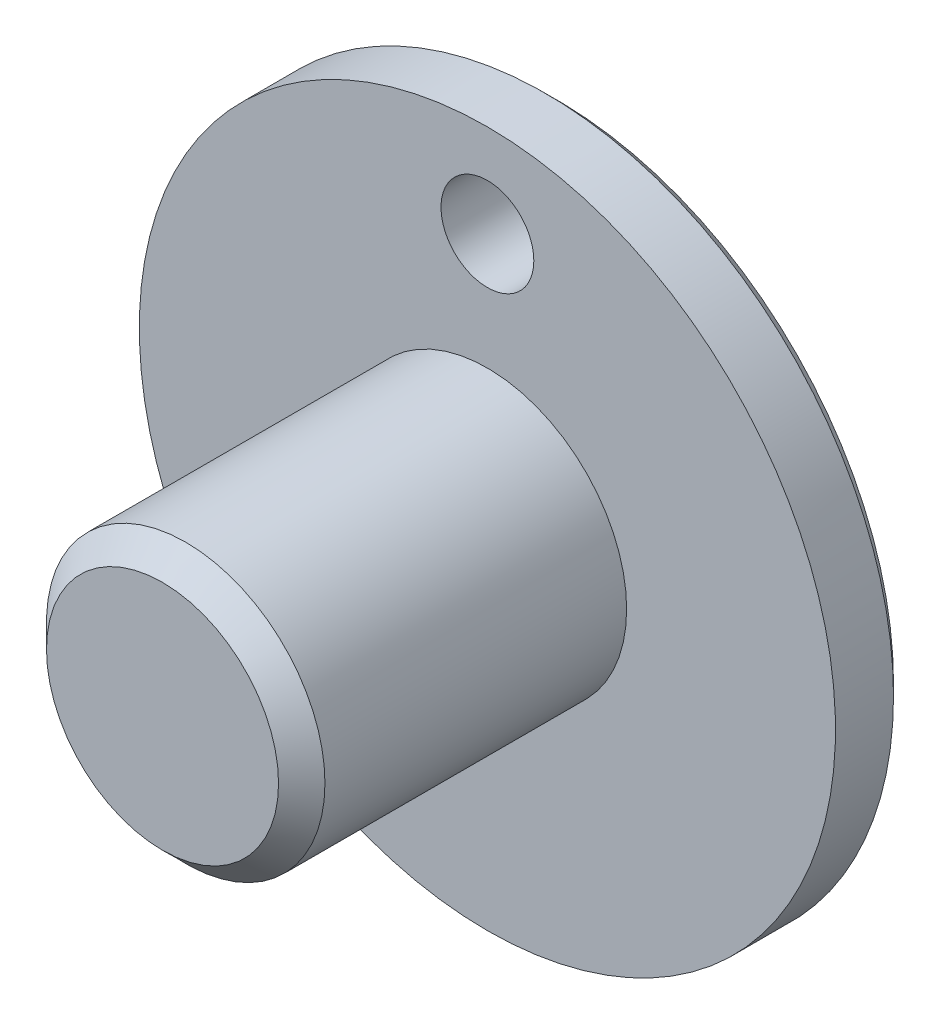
ISO-10303-21;
HEADER;
FILE_DESCRIPTION(('STEP AP214'),'2;1');
FILE_NAME('part.step','',(''),(''),'','','');
FILE_SCHEMA(('AUTOMOTIVE_DESIGN { 1 0 10303 214 1 1 1 1 }'));
ENDSEC;
DATA;
#1=APPLICATION_CONTEXT('core data for automotive mechanical design processes');
#2=APPLICATION_PROTOCOL_DEFINITION('international standard','automotive_design',2000,#1);
#3=PRODUCT_CONTEXT('',#1,'mechanical');
#4=PRODUCT('Part','Part','',(#3));
#5=PRODUCT_RELATED_PRODUCT_CATEGORY('part','',(#4));
#6=PRODUCT_DEFINITION_FORMATION('','',#4);
#7=PRODUCT_DEFINITION_CONTEXT('part definition',#1,'design');
#8=PRODUCT_DEFINITION('design','',#6,#7);
#9=PRODUCT_DEFINITION_SHAPE('','',#8);
#10=(LENGTH_UNIT() NAMED_UNIT(*) SI_UNIT(.MILLI.,.METRE.));
#11=(NAMED_UNIT(*) PLANE_ANGLE_UNIT() SI_UNIT($,.RADIAN.));
#12=(NAMED_UNIT(*) SI_UNIT($,.STERADIAN.) SOLID_ANGLE_UNIT());
#13=UNCERTAINTY_MEASURE_WITH_UNIT(LENGTH_MEASURE(1.E-05),#10,'distance_accuracy_value','');
#14=(GEOMETRIC_REPRESENTATION_CONTEXT(3) GLOBAL_UNCERTAINTY_ASSIGNED_CONTEXT((#13)) GLOBAL_UNIT_ASSIGNED_CONTEXT((#10,
#11,#12)) REPRESENTATION_CONTEXT('',''));
#15=CARTESIAN_POINT('',(0.,0.,0.));
#16=DIRECTION('',(0.,0.,1.));
#17=DIRECTION('',(1.,0.,0.));
#18=AXIS2_PLACEMENT_3D('',#15,#16,#17);
#19=CARTESIAN_POINT('',(-5.,-5.,14.));
#20=DIRECTION('',(0.,0.,1.));
#21=DIRECTION('',(1.,0.,0.));
#22=AXIS2_PLACEMENT_3D('',#19,#20,#21);
#23=PLANE('',#22);
#24=CARTESIAN_POINT('',(0.,0.,14.));
#25=DIRECTION('',(0.,0.,-1.));
#26=DIRECTION('',(0.,1.,0.));
#27=AXIS2_PLACEMENT_3D('',#24,#25,#26);
#28=CIRCLE('',#27,5.);
#29=CARTESIAN_POINT('',(0.,5.,14.));
#30=VERTEX_POINT('',#29);
#31=EDGE_CURVE('E51',#30,#30,#28,.F.);
#32=ORIENTED_EDGE('',*,*,#31,.T.);
#33=EDGE_LOOP('',(#32));
#34=FACE_BOUND('',#33,.T.);
#35=ADVANCED_FACE('F14',(#34),#23,.T.);
#36=CARTESIAN_POINT('',(0.,0.,-3.));
#37=DIRECTION('',(0.,0.,1.));
#38=DIRECTION('',(1.,0.,0.));
#39=AXIS2_PLACEMENT_3D('',#36,#37,#38);
#40=CONICAL_SURFACE('',#39,14.5,0.785398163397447);
#41=CARTESIAN_POINT('',(0.,0.,-3.));
#42=DIRECTION('',(0.,0.,1.));
#43=DIRECTION('',(1.,0.,0.));
#44=AXIS2_PLACEMENT_3D('',#41,#42,#43);
#45=CIRCLE('',#44,14.5);
#46=CARTESIAN_POINT('',(14.5,0.,-3.));
#47=VERTEX_POINT('',#46);
#48=EDGE_CURVE('E47',#47,#47,#45,.F.);
#49=ORIENTED_EDGE('',*,*,#48,.F.);
#50=EDGE_LOOP('',(#49));
#51=FACE_BOUND('',#50,.T.);
#52=CARTESIAN_POINT('',(0.,0.,-2.5));
#53=DIRECTION('',(0.,0.,1.));
#54=DIRECTION('',(1.,0.,0.));
#55=AXIS2_PLACEMENT_3D('',#52,#53,#54);
#56=CIRCLE('',#55,15.);
#57=CARTESIAN_POINT('',(15.,0.,-2.5));
#58=VERTEX_POINT('',#57);
#59=EDGE_CURVE('E50',#58,#58,#56,.F.);
#60=ORIENTED_EDGE('',*,*,#59,.T.);
#61=EDGE_LOOP('',(#60));
#62=FACE_BOUND('',#61,.T.);
#63=ADVANCED_FACE('F60',(#51,#62),#40,.T.);
#64=CARTESIAN_POINT('',(0.,0.,13.));
#65=DIRECTION('',(0.,0.,-1.));
#66=DIRECTION('',(0.,1.,0.));
#67=AXIS2_PLACEMENT_3D('',#64,#65,#66);
#68=CONICAL_SURFACE('',#67,6.,0.785398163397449);
#69=CARTESIAN_POINT('',(0.,0.,13.));
#70=DIRECTION('',(0.,0.,1.));
#71=DIRECTION('',(1.,0.,0.));
#72=AXIS2_PLACEMENT_3D('',#69,#70,#71);
#73=CIRCLE('',#72,6.);
#74=CARTESIAN_POINT('',(6.,0.,13.));
#75=VERTEX_POINT('',#74);
#76=EDGE_CURVE('E44',#75,#75,#73,.T.);
#77=ORIENTED_EDGE('',*,*,#76,.T.);
#78=EDGE_LOOP('',(#77));
#79=FACE_BOUND('',#78,.T.);
#80=ORIENTED_EDGE('',*,*,#31,.F.);
#81=EDGE_LOOP('',(#80));
#82=FACE_BOUND('',#81,.T.);
#83=ADVANCED_FACE('F57',(#79,#82),#68,.T.);
#84=CARTESIAN_POINT('',(14.5,-14.5,-3.));
#85=DIRECTION('',(0.,0.,-1.));
#86=DIRECTION('',(-1.,0.,0.));
#87=AXIS2_PLACEMENT_3D('',#84,#85,#86);
#88=PLANE('',#87);
#89=CARTESIAN_POINT('',(0.,11.,-3.));
#90=DIRECTION('',(0.,0.,1.));
#91=DIRECTION('',(1.,0.,0.));
#92=AXIS2_PLACEMENT_3D('',#89,#90,#91);
#93=CIRCLE('',#92,2.);
#94=CARTESIAN_POINT('',(2.,11.,-3.));
#95=VERTEX_POINT('',#94);
#96=EDGE_CURVE('E39',#95,#95,#93,.F.);
#97=ORIENTED_EDGE('',*,*,#96,.F.);
#98=EDGE_LOOP('',(#97));
#99=FACE_BOUND('',#98,.T.);
#100=ORIENTED_EDGE('',*,*,#48,.T.);
#101=EDGE_LOOP('',(#100));
#102=FACE_BOUND('',#101,.T.);
#103=ADVANCED_FACE('F59',(#99,#102),#88,.T.);
#104=CARTESIAN_POINT('',(0.,0.,-2.5));
#105=DIRECTION('',(0.,0.,1.));
#106=DIRECTION('',(0.,-1.,0.));
#107=AXIS2_PLACEMENT_3D('',#104,#105,#106);
#108=CYLINDRICAL_SURFACE('',#107,15.);
#109=ORIENTED_EDGE('',*,*,#59,.F.);
#110=EDGE_LOOP('',(#109));
#111=FACE_BOUND('',#110,.T.);
#112=CARTESIAN_POINT('',(0.,0.,0.));
#113=DIRECTION('',(0.,0.,1.));
#114=DIRECTION('',(0.,-1.,0.));
#115=AXIS2_PLACEMENT_3D('',#112,#113,#114);
#116=CIRCLE('',#115,15.);
#117=CARTESIAN_POINT('',(0.,-15.,0.));
#118=VERTEX_POINT('',#117);
#119=EDGE_CURVE('E27',#118,#118,#116,.T.);
#120=ORIENTED_EDGE('',*,*,#119,.F.);
#121=EDGE_LOOP('',(#120));
#122=FACE_BOUND('',#121,.T.);
#123=ADVANCED_FACE('F68',(#111,#122),#108,.T.);
#124=CARTESIAN_POINT('',(0.,0.,0.));
#125=DIRECTION('',(0.,0.,1.));
#126=DIRECTION('',(1.,0.,0.));
#127=AXIS2_PLACEMENT_3D('',#124,#125,#126);
#128=CYLINDRICAL_SURFACE('',#127,6.);
#129=CARTESIAN_POINT('',(0.,0.,0.));
#130=DIRECTION('',(0.,0.,1.));
#131=DIRECTION('',(1.,0.,0.));
#132=AXIS2_PLACEMENT_3D('',#129,#130,#131);
#133=CIRCLE('',#132,6.);
#134=CARTESIAN_POINT('',(6.,0.,0.));
#135=VERTEX_POINT('',#134);
#136=EDGE_CURVE('E22',#135,#135,#133,.F.);
#137=ORIENTED_EDGE('',*,*,#136,.F.);
#138=EDGE_LOOP('',(#137));
#139=FACE_BOUND('',#138,.T.);
#140=ORIENTED_EDGE('',*,*,#76,.F.);
#141=EDGE_LOOP('',(#140));
#142=FACE_BOUND('',#141,.T.);
#143=ADVANCED_FACE('F79',(#139,#142),#128,.T.);
#144=CARTESIAN_POINT('',(0.,11.,-3.));
#145=DIRECTION('',(0.,0.,1.));
#146=DIRECTION('',(1.,0.,0.));
#147=AXIS2_PLACEMENT_3D('',#144,#145,#146);
#148=CYLINDRICAL_SURFACE('',#147,2.);
#149=ORIENTED_EDGE('',*,*,#96,.T.);
#150=EDGE_LOOP('',(#149));
#151=FACE_BOUND('',#150,.T.);
#152=CARTESIAN_POINT('',(0.,11.,0.));
#153=DIRECTION('',(0.,0.,1.));
#154=DIRECTION('',(1.,0.,0.));
#155=AXIS2_PLACEMENT_3D('',#152,#153,#154);
#156=CIRCLE('',#155,2.);
#157=CARTESIAN_POINT('',(2.,11.,0.));
#158=VERTEX_POINT('',#157);
#159=EDGE_CURVE('E10',#158,#158,#156,.F.);
#160=ORIENTED_EDGE('',*,*,#159,.F.);
#161=EDGE_LOOP('',(#160));
#162=FACE_BOUND('',#161,.T.);
#163=ADVANCED_FACE('F75',(#151,#162),#148,.F.);
#164=CARTESIAN_POINT('',(-15.,-15.,0.));
#165=DIRECTION('',(0.,0.,1.));
#166=DIRECTION('',(1.,0.,0.));
#167=AXIS2_PLACEMENT_3D('',#164,#165,#166);
#168=PLANE('',#167);
#169=ORIENTED_EDGE('',*,*,#159,.T.);
#170=EDGE_LOOP('',(#169));
#171=FACE_BOUND('',#170,.T.);
#172=ORIENTED_EDGE('',*,*,#136,.T.);
#173=EDGE_LOOP('',(#172));
#174=FACE_BOUND('',#173,.T.);
#175=ORIENTED_EDGE('',*,*,#119,.T.);
#176=EDGE_LOOP('',(#175));
#177=FACE_BOUND('',#176,.T.);
#178=ADVANCED_FACE('F16',(#171,#174,#177),#168,.T.);
#179=CLOSED_SHELL('',(#35,#63,#83,#103,#123,#143,#163,#178));
#180=MANIFOLD_SOLID_BREP('B1',#179);
#181=ADVANCED_BREP_SHAPE_REPRESENTATION('',(#18,#180),#14);
#182=SHAPE_DEFINITION_REPRESENTATION(#9,#181);
ENDSEC;
END-ISO-10303-21;
